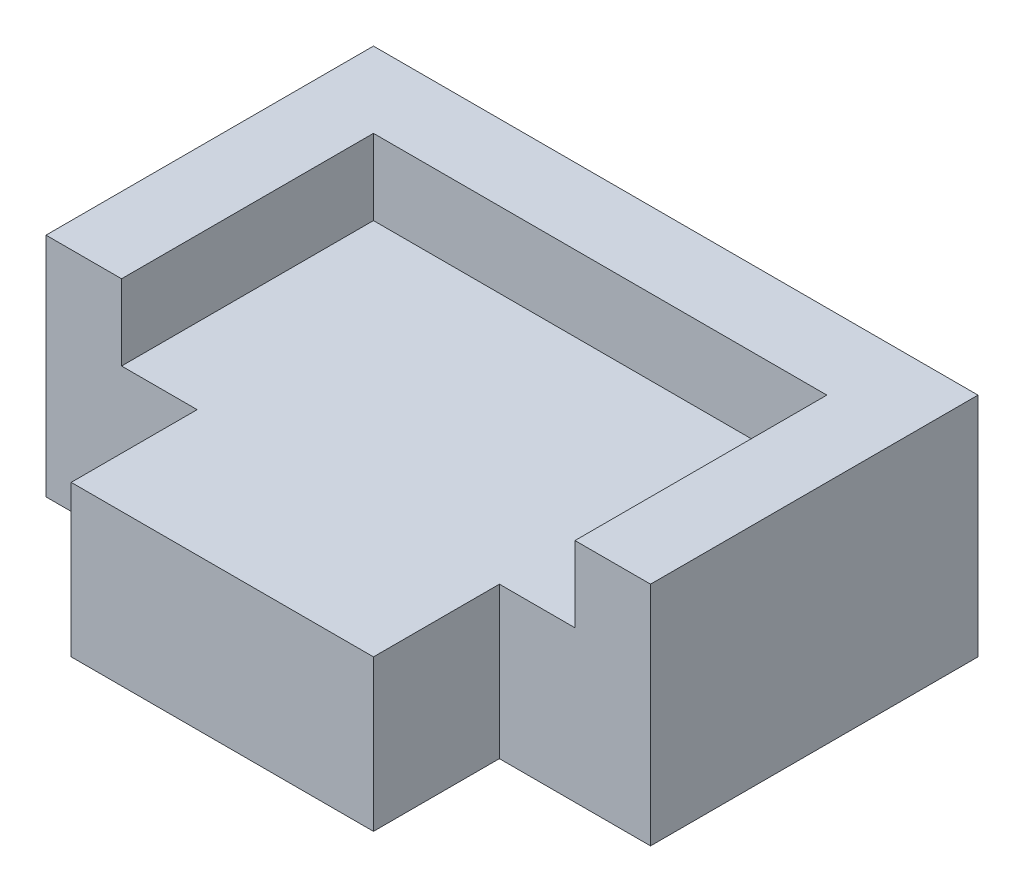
ISO-10303-21;
HEADER;
FILE_DESCRIPTION(('STEP AP214'),'2;1');
FILE_NAME('part.step','',(''),(''),'','','');
FILE_SCHEMA(('AUTOMOTIVE_DESIGN { 1 0 10303 214 1 1 1 1 }'));
ENDSEC;
DATA;
#1=APPLICATION_CONTEXT('core data for automotive mechanical design processes');
#2=APPLICATION_PROTOCOL_DEFINITION('international standard','automotive_design',2000,#1);
#3=PRODUCT_CONTEXT('',#1,'mechanical');
#4=PRODUCT('Part','Part','',(#3));
#5=PRODUCT_RELATED_PRODUCT_CATEGORY('part','',(#4));
#6=PRODUCT_DEFINITION_FORMATION('','',#4);
#7=PRODUCT_DEFINITION_CONTEXT('part definition',#1,'design');
#8=PRODUCT_DEFINITION('design','',#6,#7);
#9=PRODUCT_DEFINITION_SHAPE('','',#8);
#10=(LENGTH_UNIT() NAMED_UNIT(*) SI_UNIT(.MILLI.,.METRE.));
#11=(NAMED_UNIT(*) PLANE_ANGLE_UNIT() SI_UNIT($,.RADIAN.));
#12=(NAMED_UNIT(*) SI_UNIT($,.STERADIAN.) SOLID_ANGLE_UNIT());
#13=UNCERTAINTY_MEASURE_WITH_UNIT(LENGTH_MEASURE(1.E-05),#10,'distance_accuracy_value','');
#14=(GEOMETRIC_REPRESENTATION_CONTEXT(3) GLOBAL_UNCERTAINTY_ASSIGNED_CONTEXT((#13)) GLOBAL_UNIT_ASSIGNED_CONTEXT((#10,
#11,#12)) REPRESENTATION_CONTEXT('',''));
#15=CARTESIAN_POINT('',(0.,0.,0.));
#16=DIRECTION('',(0.,0.,1.));
#17=DIRECTION('',(1.,0.,0.));
#18=AXIS2_PLACEMENT_3D('',#15,#16,#17);
#19=CARTESIAN_POINT('',(-106.292846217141,30.,65.));
#20=DIRECTION('',(0.,0.,-1.));
#21=DIRECTION('',(-1.,0.,0.));
#22=AXIS2_PLACEMENT_3D('',#19,#20,#21);
#23=PLANE('',#22);
#24=DIRECTION('',(0.,-1.,0.));
#25=VECTOR('',#24,1.);
#26=CARTESIAN_POINT('',(-30.,30.,65.));
#27=LINE('',#26,#25);
#28=CARTESIAN_POINT('',(-30.,30.,65.));
#29=VERTEX_POINT('',#28);
#30=CARTESIAN_POINT('',(-30.,0.,65.));
#31=VERTEX_POINT('',#30);
#32=EDGE_CURVE('E47',#29,#31,#27,.T.);
#33=ORIENTED_EDGE('',*,*,#32,.F.);
#34=DIRECTION('',(1.,0.,0.));
#35=VECTOR('',#34,1.);
#36=CARTESIAN_POINT('',(-106.292846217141,30.,65.));
#37=LINE('',#36,#35);
#38=CARTESIAN_POINT('',(-45.,30.,65.));
#39=VERTEX_POINT('',#38);
#40=EDGE_CURVE('E178',#39,#29,#37,.T.);
#41=ORIENTED_EDGE('',*,*,#40,.F.);
#42=DIRECTION('',(0.,-1.,0.));
#43=VECTOR('',#42,1.);
#44=CARTESIAN_POINT('',(-45.,45.,65.));
#45=LINE('',#44,#43);
#46=CARTESIAN_POINT('',(-45.,45.,65.));
#47=VERTEX_POINT('',#46);
#48=EDGE_CURVE('E218',#47,#39,#45,.T.);
#49=ORIENTED_EDGE('',*,*,#48,.F.);
#50=DIRECTION('',(1.,0.,0.));
#51=VECTOR('',#50,1.);
#52=CARTESIAN_POINT('',(-106.292846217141,45.,65.));
#53=LINE('',#52,#51);
#54=CARTESIAN_POINT('',(-60.,45.,65.));
#55=VERTEX_POINT('',#54);
#56=EDGE_CURVE('E231',#55,#47,#53,.T.);
#57=ORIENTED_EDGE('',*,*,#56,.F.);
#58=DIRECTION('',(0.,-1.,0.));
#59=VECTOR('',#58,1.);
#60=CARTESIAN_POINT('',(-60.,45.,65.));
#61=LINE('',#60,#59);
#62=CARTESIAN_POINT('',(-60.,0.,65.));
#63=VERTEX_POINT('',#62);
#64=EDGE_CURVE('E216',#55,#63,#61,.T.);
#65=ORIENTED_EDGE('',*,*,#64,.T.);
#66=DIRECTION('',(1.,0.,0.));
#67=VECTOR('',#66,1.);
#68=CARTESIAN_POINT('',(-106.292846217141,0.,65.));
#69=LINE('',#68,#67);
#70=EDGE_CURVE('E185',#63,#31,#69,.T.);
#71=ORIENTED_EDGE('',*,*,#70,.T.);
#72=EDGE_LOOP('',(#33,#41,#49,#57,#65,#71));
#73=FACE_BOUND('',#72,.T.);
#74=ADVANCED_FACE('F31',(#73),#23,.F.);
#75=DIRECTION('',(0.,1.,0.));
#76=VECTOR('',#75,1.);
#77=CARTESIAN_POINT('',(30.,30.,65.));
#78=LINE('',#77,#76);
#79=CARTESIAN_POINT('',(30.,0.,65.));
#80=VERTEX_POINT('',#79);
#81=CARTESIAN_POINT('',(30.,30.,65.));
#82=VERTEX_POINT('',#81);
#83=EDGE_CURVE('E55',#80,#82,#78,.T.);
#84=ORIENTED_EDGE('',*,*,#83,.F.);
#85=CARTESIAN_POINT('',(60.,0.,65.));
#86=VERTEX_POINT('',#85);
#87=EDGE_CURVE('E187',#80,#86,#69,.T.);
#88=ORIENTED_EDGE('',*,*,#87,.T.);
#89=DIRECTION('',(0.,-1.,0.));
#90=VECTOR('',#89,1.);
#91=CARTESIAN_POINT('',(60.,45.,65.));
#92=LINE('',#91,#90);
#93=CARTESIAN_POINT('',(60.,45.,65.));
#94=VERTEX_POINT('',#93);
#95=EDGE_CURVE('E207',#94,#86,#92,.T.);
#96=ORIENTED_EDGE('',*,*,#95,.F.);
#97=DIRECTION('',(1.,0.,0.));
#98=VECTOR('',#97,1.);
#99=CARTESIAN_POINT('',(-106.292846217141,45.,65.));
#100=LINE('',#99,#98);
#101=CARTESIAN_POINT('',(45.,45.,65.));
#102=VERTEX_POINT('',#101);
#103=EDGE_CURVE('E241',#102,#94,#100,.T.);
#104=ORIENTED_EDGE('',*,*,#103,.F.);
#105=DIRECTION('',(0.,-1.,0.));
#106=VECTOR('',#105,1.);
#107=CARTESIAN_POINT('',(45.,45.,65.));
#108=LINE('',#107,#106);
#109=CARTESIAN_POINT('',(45.,30.,65.));
#110=VERTEX_POINT('',#109);
#111=EDGE_CURVE('E203',#102,#110,#108,.T.);
#112=ORIENTED_EDGE('',*,*,#111,.T.);
#113=EDGE_CURVE('E167',#82,#110,#37,.T.);
#114=ORIENTED_EDGE('',*,*,#113,.F.);
#115=EDGE_LOOP('',(#84,#88,#96,#104,#112,#114));
#116=FACE_BOUND('',#115,.T.);
#117=ADVANCED_FACE('F266',(#116),#23,.F.);
#118=CARTESIAN_POINT('',(-106.292846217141,30.,32.5));
#119=DIRECTION('',(0.,1.,0.));
#120=DIRECTION('',(0.,0.,1.));
#121=AXIS2_PLACEMENT_3D('',#118,#119,#120);
#122=PLANE('',#121);
#123=ORIENTED_EDGE('',*,*,#40,.T.);
#124=DIRECTION('',(0.,0.,-1.));
#125=VECTOR('',#124,1.);
#126=CARTESIAN_POINT('',(-30.,30.,90.));
#127=LINE('',#126,#125);
#128=CARTESIAN_POINT('',(-30.,30.,90.));
#129=VERTEX_POINT('',#128);
#130=EDGE_CURVE('E155',#129,#29,#127,.T.);
#131=ORIENTED_EDGE('',*,*,#130,.F.);
#132=DIRECTION('',(-1.,0.,0.));
#133=VECTOR('',#132,1.);
#134=CARTESIAN_POINT('',(-30.,30.,90.));
#135=LINE('',#134,#133);
#136=CARTESIAN_POINT('',(30.,30.,90.));
#137=VERTEX_POINT('',#136);
#138=EDGE_CURVE('E137',#137,#129,#135,.T.);
#139=ORIENTED_EDGE('',*,*,#138,.F.);
#140=DIRECTION('',(0.,0.,-1.));
#141=VECTOR('',#140,1.);
#142=CARTESIAN_POINT('',(30.,30.,90.));
#143=LINE('',#142,#141);
#144=EDGE_CURVE('E147',#137,#82,#143,.T.);
#145=ORIENTED_EDGE('',*,*,#144,.T.);
#146=ORIENTED_EDGE('',*,*,#113,.T.);
#147=DIRECTION('',(0.,0.,1.));
#148=VECTOR('',#147,1.);
#149=CARTESIAN_POINT('',(45.,30.,32.5));
#150=LINE('',#149,#148);
#151=CARTESIAN_POINT('',(45.,30.,15.));
#152=VERTEX_POINT('',#151);
#153=EDGE_CURVE('E182',#152,#110,#150,.T.);
#154=ORIENTED_EDGE('',*,*,#153,.F.);
#155=DIRECTION('',(1.,0.,0.));
#156=VECTOR('',#155,1.);
#157=CARTESIAN_POINT('',(-106.292846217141,30.,15.));
#158=LINE('',#157,#156);
#159=CARTESIAN_POINT('',(-45.,30.,15.));
#160=VERTEX_POINT('',#159);
#161=EDGE_CURVE('E39',#160,#152,#158,.T.);
#162=ORIENTED_EDGE('',*,*,#161,.F.);
#163=DIRECTION('',(0.,0.,1.));
#164=VECTOR('',#163,1.);
#165=CARTESIAN_POINT('',(-45.,30.,32.5));
#166=LINE('',#165,#164);
#167=EDGE_CURVE('E11',#160,#39,#166,.T.);
#168=ORIENTED_EDGE('',*,*,#167,.T.);
#169=EDGE_LOOP('',(#123,#131,#139,#145,#146,#154,#162,#168));
#170=FACE_BOUND('',#169,.T.);
#171=ADVANCED_FACE('F177',(#170),#122,.T.);
#172=CARTESIAN_POINT('',(-106.292846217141,0.,32.5));
#173=DIRECTION('',(0.,1.,0.));
#174=DIRECTION('',(0.,0.,1.));
#175=AXIS2_PLACEMENT_3D('',#172,#173,#174);
#176=PLANE('',#175);
#177=DIRECTION('',(0.,0.,1.));
#178=VECTOR('',#177,1.);
#179=CARTESIAN_POINT('',(60.,0.,32.5));
#180=LINE('',#179,#178);
#181=CARTESIAN_POINT('',(60.,0.,0.));
#182=VERTEX_POINT('',#181);
#183=EDGE_CURVE('E143',#182,#86,#180,.T.);
#184=ORIENTED_EDGE('',*,*,#183,.T.);
#185=ORIENTED_EDGE('',*,*,#87,.F.);
#186=DIRECTION('',(0.,0.,-1.));
#187=VECTOR('',#186,1.);
#188=CARTESIAN_POINT('',(30.,0.,90.));
#189=LINE('',#188,#187);
#190=CARTESIAN_POINT('',(30.,0.,90.));
#191=VERTEX_POINT('',#190);
#192=EDGE_CURVE('E128',#191,#80,#189,.T.);
#193=ORIENTED_EDGE('',*,*,#192,.F.);
#194=DIRECTION('',(1.,0.,0.));
#195=VECTOR('',#194,1.);
#196=CARTESIAN_POINT('',(-30.,0.,90.));
#197=LINE('',#196,#195);
#198=CARTESIAN_POINT('',(-30.,0.,90.));
#199=VERTEX_POINT('',#198);
#200=EDGE_CURVE('E121',#199,#191,#197,.T.);
#201=ORIENTED_EDGE('',*,*,#200,.F.);
#202=DIRECTION('',(0.,0.,-1.));
#203=VECTOR('',#202,1.);
#204=CARTESIAN_POINT('',(-30.,0.,90.));
#205=LINE('',#204,#203);
#206=EDGE_CURVE('E126',#199,#31,#205,.T.);
#207=ORIENTED_EDGE('',*,*,#206,.T.);
#208=ORIENTED_EDGE('',*,*,#70,.F.);
#209=DIRECTION('',(0.,0.,1.));
#210=VECTOR('',#209,1.);
#211=CARTESIAN_POINT('',(-60.,0.,32.5));
#212=LINE('',#211,#210);
#213=CARTESIAN_POINT('',(-60.,0.,0.));
#214=VERTEX_POINT('',#213);
#215=EDGE_CURVE('E224',#214,#63,#212,.T.);
#216=ORIENTED_EDGE('',*,*,#215,.F.);
#217=DIRECTION('',(1.,0.,0.));
#218=VECTOR('',#217,1.);
#219=CARTESIAN_POINT('',(-106.292846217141,0.,0.));
#220=LINE('',#219,#218);
#221=EDGE_CURVE('E145',#214,#182,#220,.T.);
#222=ORIENTED_EDGE('',*,*,#221,.T.);
#223=EDGE_LOOP('',(#184,#185,#193,#201,#207,#208,#216,#222));
#224=FACE_BOUND('',#223,.T.);
#225=ADVANCED_FACE('F124',(#224),#176,.F.);
#226=CARTESIAN_POINT('',(-106.292846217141,45.,15.));
#227=DIRECTION('',(0.,0.,-1.));
#228=DIRECTION('',(-1.,0.,0.));
#229=AXIS2_PLACEMENT_3D('',#226,#227,#228);
#230=PLANE('',#229);
#231=ORIENTED_EDGE('',*,*,#161,.T.);
#232=DIRECTION('',(0.,-1.,0.));
#233=VECTOR('',#232,1.);
#234=CARTESIAN_POINT('',(45.,45.,15.));
#235=LINE('',#234,#233);
#236=CARTESIAN_POINT('',(45.,45.,15.));
#237=VERTEX_POINT('',#236);
#238=EDGE_CURVE('E192',#237,#152,#235,.T.);
#239=ORIENTED_EDGE('',*,*,#238,.F.);
#240=DIRECTION('',(1.,0.,0.));
#241=VECTOR('',#240,1.);
#242=CARTESIAN_POINT('',(-106.292846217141,45.,15.));
#243=LINE('',#242,#241);
#244=CARTESIAN_POINT('',(-45.,45.,15.));
#245=VERTEX_POINT('',#244);
#246=EDGE_CURVE('E162',#245,#237,#243,.T.);
#247=ORIENTED_EDGE('',*,*,#246,.F.);
#248=DIRECTION('',(0.,-1.,0.));
#249=VECTOR('',#248,1.);
#250=CARTESIAN_POINT('',(-45.,45.,15.));
#251=LINE('',#250,#249);
#252=EDGE_CURVE('E220',#245,#160,#251,.T.);
#253=ORIENTED_EDGE('',*,*,#252,.T.);
#254=EDGE_LOOP('',(#231,#239,#247,#253));
#255=FACE_BOUND('',#254,.T.);
#256=ADVANCED_FACE('F249',(#255),#230,.F.);
#257=CARTESIAN_POINT('',(45.,45.,32.5));
#258=DIRECTION('',(1.,0.,0.));
#259=DIRECTION('',(0.,0.,-1.));
#260=AXIS2_PLACEMENT_3D('',#257,#258,#259);
#261=PLANE('',#260);
#262=ORIENTED_EDGE('',*,*,#153,.T.);
#263=ORIENTED_EDGE('',*,*,#111,.F.);
#264=DIRECTION('',(0.,0.,1.));
#265=VECTOR('',#264,1.);
#266=CARTESIAN_POINT('',(45.,45.,32.5));
#267=LINE('',#266,#265);
#268=EDGE_CURVE('E242',#237,#102,#267,.T.);
#269=ORIENTED_EDGE('',*,*,#268,.F.);
#270=ORIENTED_EDGE('',*,*,#238,.T.);
#271=EDGE_LOOP('',(#262,#263,#269,#270));
#272=FACE_BOUND('',#271,.T.);
#273=ADVANCED_FACE('F341',(#272),#261,.F.);
#274=CARTESIAN_POINT('',(60.,45.,32.5));
#275=DIRECTION('',(1.,0.,0.));
#276=DIRECTION('',(0.,0.,-1.));
#277=AXIS2_PLACEMENT_3D('',#274,#275,#276);
#278=PLANE('',#277);
#279=ORIENTED_EDGE('',*,*,#183,.F.);
#280=DIRECTION('',(0.,-1.,0.));
#281=VECTOR('',#280,1.);
#282=CARTESIAN_POINT('',(60.,45.,0.));
#283=LINE('',#282,#281);
#284=CARTESIAN_POINT('',(60.,45.,0.));
#285=VERTEX_POINT('',#284);
#286=EDGE_CURVE('E210',#285,#182,#283,.T.);
#287=ORIENTED_EDGE('',*,*,#286,.F.);
#288=DIRECTION('',(0.,0.,1.));
#289=VECTOR('',#288,1.);
#290=CARTESIAN_POINT('',(60.,45.,32.5));
#291=LINE('',#290,#289);
#292=EDGE_CURVE('E238',#285,#94,#291,.T.);
#293=ORIENTED_EDGE('',*,*,#292,.T.);
#294=ORIENTED_EDGE('',*,*,#95,.T.);
#295=EDGE_LOOP('',(#279,#287,#293,#294));
#296=FACE_BOUND('',#295,.T.);
#297=ADVANCED_FACE('F265',(#296),#278,.T.);
#298=CARTESIAN_POINT('',(-106.292846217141,45.,0.));
#299=DIRECTION('',(0.,0.,-1.));
#300=DIRECTION('',(-1.,0.,0.));
#301=AXIS2_PLACEMENT_3D('',#298,#299,#300);
#302=PLANE('',#301);
#303=ORIENTED_EDGE('',*,*,#221,.F.);
#304=DIRECTION('',(0.,-1.,0.));
#305=VECTOR('',#304,1.);
#306=CARTESIAN_POINT('',(-60.,45.,0.));
#307=LINE('',#306,#305);
#308=CARTESIAN_POINT('',(-60.,45.,0.));
#309=VERTEX_POINT('',#308);
#310=EDGE_CURVE('E214',#309,#214,#307,.T.);
#311=ORIENTED_EDGE('',*,*,#310,.F.);
#312=DIRECTION('',(1.,0.,0.));
#313=VECTOR('',#312,1.);
#314=CARTESIAN_POINT('',(-106.292846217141,45.,0.));
#315=LINE('',#314,#313);
#316=EDGE_CURVE('E235',#309,#285,#315,.T.);
#317=ORIENTED_EDGE('',*,*,#316,.T.);
#318=ORIENTED_EDGE('',*,*,#286,.T.);
#319=EDGE_LOOP('',(#303,#311,#317,#318));
#320=FACE_BOUND('',#319,.T.);
#321=ADVANCED_FACE('F262',(#320),#302,.T.);
#322=CARTESIAN_POINT('',(-60.,45.,32.5));
#323=DIRECTION('',(1.,0.,0.));
#324=DIRECTION('',(0.,0.,-1.));
#325=AXIS2_PLACEMENT_3D('',#322,#323,#324);
#326=PLANE('',#325);
#327=ORIENTED_EDGE('',*,*,#215,.T.);
#328=ORIENTED_EDGE('',*,*,#64,.F.);
#329=DIRECTION('',(0.,0.,1.));
#330=VECTOR('',#329,1.);
#331=CARTESIAN_POINT('',(-60.,45.,32.5));
#332=LINE('',#331,#330);
#333=EDGE_CURVE('E233',#309,#55,#332,.T.);
#334=ORIENTED_EDGE('',*,*,#333,.F.);
#335=ORIENTED_EDGE('',*,*,#310,.T.);
#336=EDGE_LOOP('',(#327,#328,#334,#335));
#337=FACE_BOUND('',#336,.T.);
#338=ADVANCED_FACE('F258',(#337),#326,.F.);
#339=CARTESIAN_POINT('',(-45.,45.,32.5));
#340=DIRECTION('',(1.,0.,0.));
#341=DIRECTION('',(0.,0.,-1.));
#342=AXIS2_PLACEMENT_3D('',#339,#340,#341);
#343=PLANE('',#342);
#344=ORIENTED_EDGE('',*,*,#48,.T.);
#345=ORIENTED_EDGE('',*,*,#167,.F.);
#346=ORIENTED_EDGE('',*,*,#252,.F.);
#347=DIRECTION('',(0.,0.,1.));
#348=VECTOR('',#347,1.);
#349=CARTESIAN_POINT('',(-45.,45.,32.5));
#350=LINE('',#349,#348);
#351=EDGE_CURVE('E223',#245,#47,#350,.T.);
#352=ORIENTED_EDGE('',*,*,#351,.T.);
#353=EDGE_LOOP('',(#344,#345,#346,#352));
#354=FACE_BOUND('',#353,.T.);
#355=ADVANCED_FACE('F251',(#354),#343,.T.);
#356=CARTESIAN_POINT('',(-106.292846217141,45.,32.5));
#357=DIRECTION('',(0.,1.,0.));
#358=DIRECTION('',(0.,0.,1.));
#359=AXIS2_PLACEMENT_3D('',#356,#357,#358);
#360=PLANE('',#359);
#361=ORIENTED_EDGE('',*,*,#246,.T.);
#362=ORIENTED_EDGE('',*,*,#268,.T.);
#363=ORIENTED_EDGE('',*,*,#103,.T.);
#364=ORIENTED_EDGE('',*,*,#292,.F.);
#365=ORIENTED_EDGE('',*,*,#316,.F.);
#366=ORIENTED_EDGE('',*,*,#333,.T.);
#367=ORIENTED_EDGE('',*,*,#56,.T.);
#368=ORIENTED_EDGE('',*,*,#351,.F.);
#369=EDGE_LOOP('',(#361,#362,#363,#364,#365,#366,#367,#368));
#370=FACE_BOUND('',#369,.T.);
#371=ADVANCED_FACE('F247',(#370),#360,.T.);
#372=CARTESIAN_POINT('',(-30.,30.,90.));
#373=DIRECTION('',(1.,0.,0.));
#374=DIRECTION('',(0.,1.,0.));
#375=AXIS2_PLACEMENT_3D('',#372,#373,#374);
#376=PLANE('',#375);
#377=ORIENTED_EDGE('',*,*,#32,.T.);
#378=ORIENTED_EDGE('',*,*,#206,.F.);
#379=DIRECTION('',(0.,-1.,0.));
#380=VECTOR('',#379,1.);
#381=CARTESIAN_POINT('',(-30.,30.,90.));
#382=LINE('',#381,#380);
#383=EDGE_CURVE('E132',#129,#199,#382,.T.);
#384=ORIENTED_EDGE('',*,*,#383,.F.);
#385=ORIENTED_EDGE('',*,*,#130,.T.);
#386=EDGE_LOOP('',(#377,#378,#384,#385));
#387=FACE_BOUND('',#386,.T.);
#388=ADVANCED_FACE('F142',(#387),#376,.F.);
#389=CARTESIAN_POINT('',(30.,30.,90.));
#390=DIRECTION('',(-1.,0.,0.));
#391=DIRECTION('',(0.,-1.,0.));
#392=AXIS2_PLACEMENT_3D('',#389,#390,#391);
#393=PLANE('',#392);
#394=ORIENTED_EDGE('',*,*,#83,.T.);
#395=ORIENTED_EDGE('',*,*,#144,.F.);
#396=DIRECTION('',(0.,1.,0.));
#397=VECTOR('',#396,1.);
#398=CARTESIAN_POINT('',(30.,30.,90.));
#399=LINE('',#398,#397);
#400=EDGE_CURVE('E131',#191,#137,#399,.T.);
#401=ORIENTED_EDGE('',*,*,#400,.F.);
#402=ORIENTED_EDGE('',*,*,#192,.T.);
#403=EDGE_LOOP('',(#394,#395,#401,#402));
#404=FACE_BOUND('',#403,.T.);
#405=ADVANCED_FACE('F176',(#404),#393,.F.);
#406=CARTESIAN_POINT('',(-30.,30.,90.));
#407=DIRECTION('',(0.,0.,1.));
#408=DIRECTION('',(1.,0.,0.));
#409=AXIS2_PLACEMENT_3D('',#406,#407,#408);
#410=PLANE('',#409);
#411=ORIENTED_EDGE('',*,*,#383,.T.);
#412=ORIENTED_EDGE('',*,*,#200,.T.);
#413=ORIENTED_EDGE('',*,*,#400,.T.);
#414=ORIENTED_EDGE('',*,*,#138,.T.);
#415=EDGE_LOOP('',(#411,#412,#413,#414));
#416=FACE_BOUND('',#415,.T.);
#417=ADVANCED_FACE('F135',(#416),#410,.T.);
#418=CLOSED_SHELL('',(#74,#117,#171,#225,#256,#273,#297,#321,#338,#355,#371,#388,#405,#417));
#419=MANIFOLD_SOLID_BREP('B2',#418);
#420=ADVANCED_BREP_SHAPE_REPRESENTATION('',(#18,#419),#14);
#421=SHAPE_DEFINITION_REPRESENTATION(#9,#420);
ENDSEC;
END-ISO-10303-21;
